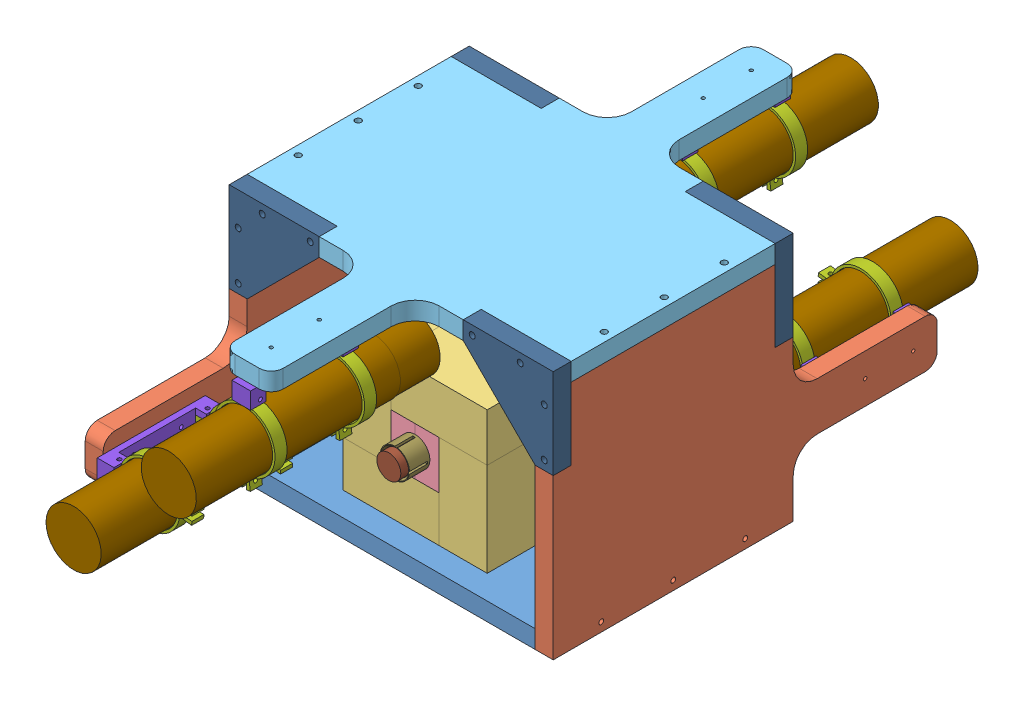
SolidWorks assembly PolarimetryAssembly.SLDASM, configuration Default (file format 8000). Lengths in mm.
Overall size (342.9 264.16 726.13).
39 component instances, 13 part files, 94 mates.
Components (placement in the parent):
- PolarimetryBasePiece-1: PolarimetryBasePiece.SLDPRT [Default] at (179.036 122.9383 224.0635) size (304.8 19.05 254)
- PolarimetrySidePiece-1: PolarimetrySidePiece.SLDPRT [Default] at (-75.8459 245.4933 261.1051) x (0 0 1) z (0 -1 0) size (406.4 19.05 245.11)
- PolarimetrySidePiece-2: PolarimetrySidePiece.SLDPRT [Default] at (228.9541 245.4933 261.1051) x (0 0 -1) z (0 -1 0) size (406.4 19.05 245.11)
- BigLeadBlock-1: BigLeadBlock.SLDPRT [Default] at (0.3541 139.4483 362.7051) x (0 0 -1) z (1 0 0) size (203.2 50.8 101.6)
- BigLeadBlock-2: BigLeadBlock.SLDPRT [Default] at (101.9541 241.0483 362.7051) x (0 0 -1) z (0 -1 0) size (203.2 50.8 101.6)
- LeadHouseInternalBlock-1: LeadHouseInternalBlock.SLDPRT [Default] at (76.5541 190.2483 261.1051) x (0 0 1) z (0 1 0) size (101.6 25.4 50.8)
- LeadHouseInternalBlock-2: LeadHouseInternalBlock.SLDPRT [Default] at (76.5541 241.0483 261.1051) x (0 0 -1) z (0 -1 0) size (101.6 25.4 50.8)
- LeadHouseInternalBlock-3: LeadHouseInternalBlock.SLDPRT [Default] at (76.5541 241.0483 261.1051) x (0 0 1) z (0 -1 0) size (101.6 25.4 50.8)
- LeadHouseInternalBlock-4: LeadHouseInternalBlock.SLDPRT [Default] at (76.5541 190.2483 261.1051) x (0 0 -1) z (0 1 0) size (101.6 25.4 50.8)
- BigLeadBlock-3: BigLeadBlock.SLDPRT [Default] at (51.1541 190.2483 362.7051) x (0 0 -1) z (0 1 0) size (203.2 50.8 101.6)
- BigLeadBlock-4: BigLeadBlock.SLDPRT [Default] at (51.1541 241.0483 362.7051) x (0 0 -1) z (1 0 0) size (203.2 50.8 101.6)
- PolarimetryTopPiece-1: PolarimetryTopPiece.SLDPRT [Default] at (76.5541 368.0483 261.1051) x (0 0 -1) z (1 0 0) size (558.8 19.05 342.9)
- PolarimetryKey-1: PolarimetryKey.SLDPRT [Default] at (209.9041 122.9383 159.5051) x (0 0 -1) z (0 -1 0) size (203.2 19.05 25.4)
- PolarimetryKey-2: PolarimetryKey.SLDPRT [Default] at (-75.8459 122.9383 159.5051) x (0 0 -1) z (0 -1 0) size (203.2 19.05 25.4)
- DetectorClamp-1: DetectorClamp.SLDPRT [Default] at (177.4211 216.0293 85.4541) x (0 -1 0) z (1 0 0) size (64.77 12.7 90.11)
- DetectorClampBar-1: DetectorClampBar.SLDPRT [Default] at (228.9541 205.7423 -24.6449) x (0 0 1) z (0 -1 0) size (114.3 17.78 19.81)
- DetectorClamp-2: DetectorClamp.SLDPRT [Default] at (177.4211 216.0293 -20.5813) x (0 1 0) z (1 0 0) size (64.77 12.7 90.11)
- DetectorModel-1: DetectorModel.SLDPRT [Default] at (177.4211 216.0293 113.0448) x (0.987772 0.155906 0) z (-0.155906 0.987772 0) size (58.42 258.57 58.42)
- DetectorClampBar-2: DetectorClampBar.SLDPRT [Default] at (66.6481 368.0483 89.6551) x (0 0 -1) z (-1 0 0) size (114.3 17.78 19.81)
- DetectorClamp-3: DetectorClamp.SLDPRT [Default] at (76.1731 316.5153 -20.5813) x (-1 0 0) z (0 1 0) size (64.77 12.7 90.11)
- DetectorClamp-4: DetectorClamp.SLDPRT [Default] at (76.1731 316.5153 85.5916) x (1 0 0) z (0 1 0) size (64.77 12.7 90.11)
- DetectorModel-2: DetectorModel.SLDPRT [Default] at (76.1731 316.5153 117.214) x (1 0 0) z (0 1 0) size (58.42 258.57 58.42)
- PolarimetryGusset-1: PolarimetryGusset.SLDPRT [Default] at (-94.8959 291.8483 153.1551) x (1 0 0) z (0 1 0) size (95.25 19.05 95.25)
- PolarimetryGusset-3: PolarimetryGusset.SLDPRT [Default] at (152.7541 387.0983 388.1051) x (0 -1 0) z (1 0 0) size (95.25 19.05 95.25)
- PolarimetryGusset-4: PolarimetryGusset.SLDPRT [Default] at (-94.8959 291.8483 388.1051) x (1 0 0) z (0 1 0) size (95.25 19.05 95.25)
- PolarimetryGusset-5: PolarimetryGusset.SLDPRT [Default] at (248.0041 291.8483 134.1051) x (-1 0 0) z (0 1 0) size (95.25 19.05 95.25)
- AluminumScatterer-1: AluminumScatterer.SLDPRT [Default] at (76.5541 215.6483 390.6451) x (1 0 0) z (0 1 0) size (25.4 25.4 25.4)
- PolarimetryAluminumHolder-1: PolarimetryAluminumHolder.SLDPRT [Default] at (76.5541 215.6483 337.3051) x (1 0 0) z (0 -1 0) size (30.99 46.99 30.99)
- PolarimetryAluminumHolder-2: PolarimetryAluminumHolder.SLDPRT [Default] at (76.5541 215.6483 184.9051) x (-0.923728 -0.383049 0) z (0.383049 -0.923728 0) size (30.99 46.99 30.99)
- AluminumScatterer-2: AluminumScatterer.SLDPRT [Default] at (76.5541 215.6483 156.9651) x (1 0 0) z (0 1 0) size (25.4 25.4 25.4)
- DetectorClampBar-3: DetectorClampBar.SLDPRT [Default] at (66.6453 368.0483 546.8508) x (0.000433 0 -1) z (-1 0 -0.000433) size (114.3 17.78 19.81)
- DetectorClampBar-4: DetectorClampBar.SLDPRT [Default] at (-75.8459 225.5543 432.5551) x (0 0 1) z (0 1 0) size (114.3 17.78 19.81)
- DetectorClamp-5: DetectorClamp.SLDPRT [Default] at (-24.4109 216.0293 543.0451) x (0 1 0) z (-1 0 0) size (64.77 12.7 90.11)
- DetectorClamp-6: DetectorClamp.SLDPRT [Default] at (-24.4109 216.0293 449.0651) x (0 1 0) z (-1 0 0) size (64.77 12.7 90.11)
- DetectorClamp-7: DetectorClamp.SLDPRT [Default] at (76.172 316.6133 543.045) x (1 0 0.000433) z (0 1 0) size (64.77 12.7 90.11)
- DetectorClamp-8: DetectorClamp.SLDPRT [Default] at (76.9747 316.6133 449.0653) x (1 0 0.000433) z (0 1 0) size (64.77 12.7 90.11)
- DetectorModel-3: DetectorModel.SLDPRT [Default] at (76.2308 316.6133 407.1793) x (0.511772 -0.859122 0.000222) z (-0.859121 -0.511772 -0.000372) size (58.42 258.57 58.42)
- DetectorModel-4: DetectorModel.SLDPRT [Default] at (-24.4109 216.0293 407.3726) x (0.993621 -0.112775 0) z (-0.112775 -0.993621 0) size (58.42 258.57 58.42)
- SmallLeadBlock-1: SmallLeadBlock.SLDPRT [Default] at (22.7686 342.6483 249.6097) x (1 0 0) z (0 -1 0) size (101.6 25.4 50.8)
Mates (geometry in assembly coordinates):
- Coincident2: coincident aligned: plane of PolarimetryBasePiece-1 through (179.036 122.9383 224.0635) normal (0 -1 0); plane of PolarimetrySidePiece-1 through (-94.8959 122.9383 261.1051) normal (0 -1 0)
- Coincident3: coincident aligned: plane of PolarimetryBasePiece-1 through (-75.8459 141.9883 388.1051) normal (0 0 1); plane of PolarimetrySidePiece-1 through (-94.8959 245.4933 388.1051) normal (0 0 1)
- Coincident4: coincident anti-aligned: plane of PolarimetryBasePiece-1 through (-75.8459 141.9883 134.1051) normal (-1 0 0); plane of PolarimetrySidePiece-1 through (-75.8459 245.4933 261.1051) normal (1 0 0)
- Coincident5: coincident aligned: plane of PolarimetryBasePiece-1 through (179.036 122.9383 224.0635) normal (0 -1 0); plane of PolarimetrySidePiece-2 through (248.0041 122.9383 261.1051) normal (0 -1 0)
- Coincident6: coincident aligned: plane of PolarimetryBasePiece-1 through (-75.8459 141.9883 388.1051) normal (0 0 1); plane of PolarimetrySidePiece-2 through (248.0041 245.4933 388.1051) normal (0 0 1)
- Coincident7: coincident anti-aligned: plane of PolarimetryBasePiece-1 through (228.9541 141.9883 134.1051) normal (1 0 0); plane of PolarimetrySidePiece-2 through (228.9541 245.4933 261.1051) normal (-1 0 0)
- Coincident8: coincident anti-aligned: plane of PolarimetryBasePiece-1 through (179.036 139.4483 224.0635) normal (0 1 0); plane of BigLeadBlock-1 through (0.3541 139.4483 362.7051) normal (0 -1 0)
- Coincident9: coincident anti-aligned: plane of PolarimetryBasePiece-1 through (0.3541 139.4483 362.7051) normal (1 0 0); plane of BigLeadBlock-1 through (0.3541 190.2483 362.7051) normal (-1 0 0)
- Coincident10: coincident anti-aligned: plane of PolarimetryBasePiece-1 through (0.3541 139.4483 362.7051) normal (0 0 -1); plane of BigLeadBlock-1 through (0.3541 190.2483 362.7051) normal (0 0 1)
- Coincident11: coincident anti-aligned: plane of PolarimetryBasePiece-1 through (179.036 139.4483 224.0635) normal (0 1 0); plane of BigLeadBlock-2 through (152.7541 139.4483 362.7051) normal (0 -1 0)
- Coincident12: coincident anti-aligned: plane of BigLeadBlock-1 through (101.9541 190.2483 362.7051) normal (1 0 0); plane of BigLeadBlock-2 through (101.9541 241.0483 362.7051) normal (-1 0 0)
- Coincident13: coincident anti-aligned: plane of PolarimetryBasePiece-1 through (0.3541 139.4483 362.7051) normal (0 0 -1); plane of BigLeadBlock-2 through (152.7541 241.0483 362.7051) normal (0 0 1)
- Coincident14: coincident anti-aligned: plane of BigLeadBlock-1 through (0.3541 190.2483 362.7051) normal (0 1 0); plane of LeadHouseInternalBlock-1 through (101.9541 190.2483 261.1051) normal (0 -1 0)
- Coincident15: coincident anti-aligned: plane of BigLeadBlock-2 through (101.9541 241.0483 362.7051) normal (-1 0 0); plane of LeadHouseInternalBlock-1 through (101.9541 190.2483 261.1051) normal (1 0 0)
- Coincident16: coincident aligned: plane of BigLeadBlock-2 through (152.7541 241.0483 362.7051) normal (0 0 1); plane of LeadHouseInternalBlock-1 through (101.9541 190.2483 362.7051) normal (0 0 1)
- Coincident17: coincident anti-aligned: plane of LeadHouseInternalBlock-1 through (101.9541 190.2483 261.1051) normal (0 0 -1); plane of LeadHouseInternalBlock-2 through (101.9541 241.0483 261.1051) normal (0 0 1)
- Coincident18: coincident anti-aligned: circle of LeadHouseInternalBlock-1; circle of LeadHouseInternalBlock-2
- Coincident19: coincident aligned: plane of LeadHouseInternalBlock-1 through (101.9541 241.0483 261.1051) normal (0 1 0); plane of LeadHouseInternalBlock-2 through (101.9541 241.0483 261.1051) normal (0 1 0)
- Coincident20: coincident anti-aligned: plane of BigLeadBlock-1 through (0.3541 190.2483 362.7051) normal (0 1 0); plane of LeadHouseInternalBlock-3 through (51.1541 190.2483 261.1051) normal (0 -1 0)
- Coincident21: coincident aligned: circle of LeadHouseInternalBlock-1; circle of LeadHouseInternalBlock-3
- Coincident22: coincident anti-aligned: circle of LeadHouseInternalBlock-3; circle of LeadHouseInternalBlock-4
- Coincident23: coincident anti-aligned: plane of BigLeadBlock-1 through (0.3541 190.2483 362.7051) normal (0 1 0); plane of LeadHouseInternalBlock-4 through (51.1541 190.2483 261.1051) normal (0 -1 0)
- Coincident25: coincident anti-aligned: plane of BigLeadBlock-1 through (0.3541 190.2483 362.7051) normal (0 1 0); plane of BigLeadBlock-3 through (0.3541 190.2483 362.7051) normal (0 -1 0)
- Coincident26: coincident aligned: plane of BigLeadBlock-1 through (0.3541 190.2483 159.5051) normal (0 0 -1); plane of BigLeadBlock-3 through (0.3541 190.2483 159.5051) normal (0 0 -1)
- Coincident27: coincident aligned: plane of BigLeadBlock-1 through (0.3541 190.2483 362.7051) normal (-1 0 0); plane of BigLeadBlock-3 through (0.3541 190.2483 362.7051) normal (-1 0 0)
- Coincident28: coincident anti-aligned: plane of BigLeadBlock-3 through (51.1541 190.2483 362.7051) normal (1 0 0); plane of BigLeadBlock-4 through (51.1541 291.8483 362.7051) normal (-1 0 0)
- Coincident29: coincident anti-aligned: plane of BigLeadBlock-2 through (152.7541 241.0483 362.7051) normal (0 1 0); plane of BigLeadBlock-4 through (51.1541 241.0483 362.7051) normal (0 -1 0)
- Coincident30: coincident aligned: plane of BigLeadBlock-2 through (152.7541 241.0483 362.7051) normal (0 0 1); plane of BigLeadBlock-4 through (51.1541 291.8483 362.7051) normal (0 0 1)
- Coincident31: coincident anti-aligned: plane of PolarimetrySidePiece-1 through (-94.8959 368.0483 261.1051) normal (0 1 0); plane of PolarimetryTopPiece-1 through (76.5541 368.0483 261.1051) normal (0 -1 0)
- Coincident32: coincident aligned: plane of PolarimetrySidePiece-1 through (-94.8959 245.4933 388.1051) normal (0 0 1); plane of PolarimetryTopPiece-1 through (76.5541 387.0983 388.1051) normal (0 0 1)
- Coincident33: coincident aligned: plane of PolarimetrySidePiece-1 through (-94.8959 245.4933 261.1051) normal (-1 0 0); plane of PolarimetryTopPiece-1 through (-94.8959 387.0983 261.1051) normal (-1 0 0)
- Coincident38: coincident anti-aligned: plane of PolarimetryBasePiece-1 through (-75.8459 122.9383 362.7051) normal (0 0 -1); plane of PolarimetryKey-2 through (-56.7959 122.9383 362.7051) normal (0 0 1)
- Coincident40: coincident anti-aligned: plane of PolarimetrySidePiece-2 through (228.9541 245.4933 261.1051) normal (-1 0 0); plane of DetectorClampBar-1 through (228.9541 205.7423 -24.6449) normal (1 0 0)
- Concentric1: concentric aligned: circle of PolarimetrySidePiece-2; circle of DetectorClampBar-1
- Parallel1: parallel anti-aligned: plane of DetectorClamp-1 through (222.5061 219.2043 72.7541) normal (1 0 0); plane of DetectorClampBar-1 through (222.6041 205.7423 -24.6449) normal (-1 0 0)
- Coincident46: coincident aligned: circle of DetectorClamp-1; plane of DetectorClampBar-1 through (211.1741 219.2043 85.8451) normal (0 -1 0)
- Concentric3: concentric anti-aligned: circle of PolarimetrySidePiece-2; circle of DetectorClampBar-1
- Parallel2: parallel anti-aligned: plane of DetectorClampBar-1 through (222.6041 205.7423 -24.6449) normal (-1 0 0); plane of DetectorClamp-2 through (222.5061 212.8543 -7.8813) normal (1 0 0)
- Coincident47: coincident aligned: circle of DetectorClampBar-1; circle of DetectorClamp-2
- Concentric4: concentric anti-aligned: cylinder of DetectorClamp-2 through (177.4211 216.0293 -7.8813) axis (0 0 -1) radius 29.845; cylinder of DetectorModel-1 through (177.4211 216.0293 -102.8552) axis (0 0 1) radius 29.21
- Coincident48: coincident anti-aligned: plane of PolarimetryTopPiece-1 through (76.5541 368.0483 261.1051) normal (0 -1 0); plane of DetectorClampBar-2 through (66.6481 368.0483 89.6551) normal (0 1 0)
- Concentric5: concentric aligned: circle of PolarimetryTopPiece-1; circle of DetectorClampBar-2
- Concentric6: concentric anti-aligned: circle of PolarimetryTopPiece-1; circle of DetectorClampBar-2
- Parallel3: parallel anti-aligned: plane of DetectorClampBar-2 through (66.6481 361.6983 89.6551) normal (0 -1 0); plane of DetectorClamp-3 through (79.3481 361.6003 -7.8813) normal (0 1 0)
- Coincident50: coincident aligned: circle of DetectorClamp-3; circle of DetectorClampBar-2
- Parallel4: parallel anti-aligned: plane of DetectorClampBar-2 through (66.6481 361.6983 89.6551) normal (0 -1 0); plane of DetectorClamp-4 through (72.9981 361.6003 72.8916) normal (0 1 0)
- Coincident52: coincident anti-aligned: circle of DetectorClampBar-2; circle of DetectorClamp-4
- Concentric7: concentric anti-aligned: cylinder of DetectorClamp-3 through (76.1731 316.5153 -7.8813) axis (0 0 -1) radius 29.845; cylinder of DetectorModel-2 through (76.1731 316.5153 -98.686) axis (0 0 1) radius 29.21
- Parallel5: parallel aligned: plane of DetectorModel-1 through (177.4211 216.0293 155.7168) normal (0 0 1); plane of DetectorModel-2 through (76.1731 316.5153 159.886) normal (0 0 1)
- Coincident54: coincident anti-aligned: plane of PolarimetrySidePiece-1 through (-75.8459 245.4933 261.1051) normal (1 0 0); plane of PolarimetryKey-2 through (-75.8459 122.9383 159.5051) normal (-1 0 0)
- Parallel7: parallel aligned: plane of PolarimetrySidePiece-1 through (-94.8959 122.9383 261.1051) normal (0 -1 0); plane of PolarimetryKey-2 through (-56.7959 122.9383 159.5051) normal (0 -1 0)
- Coincident56: coincident anti-aligned: plane of PolarimetrySidePiece-2 through (228.9541 245.4933 261.1051) normal (-1 0 0); plane of PolarimetryKey-1 through (228.9541 122.9383 159.5051) normal (1 0 0)
- Coincident62: coincident anti-aligned: plane of PolarimetryTopPiece-1 through (76.5541 368.0483 153.1551) normal (0 0 -1); plane of PolarimetryGusset-1 through (-94.8959 291.8483 153.1551) normal (0 0 1)
- Coincident63: coincident aligned: plane of PolarimetryTopPiece-1 through (76.5541 387.0983 261.1051) normal (0 1 0); plane of PolarimetryGusset-1 through (-94.8959 387.0983 134.1051) normal (0 1 0)
- Coincident67: coincident aligned: plane of PolarimetryTopPiece-1 through (76.5541 387.0983 261.1051) normal (0 1 0); plane of PolarimetryGusset-3 through (152.7541 387.0983 369.0551) normal (0 1 0)
- Coincident68: coincident anti-aligned: plane of PolarimetryTopPiece-1 through (76.5541 368.0483 369.0551) normal (0 0 1); plane of PolarimetryGusset-3 through (152.7541 387.0983 369.0551) normal (0 0 -1)
- Coincident69: coincident aligned: plane of PolarimetrySidePiece-2 through (248.0041 245.4933 261.1051) normal (1 0 0); plane of PolarimetryGusset-3 through (248.0041 387.0983 369.0551) normal (1 0 0)
- Coincident70: coincident anti-aligned: plane of PolarimetryTopPiece-1 through (76.5541 368.0483 369.0551) normal (0 0 1); plane of PolarimetryGusset-4 through (-94.8959 291.8483 369.0551) normal (0 0 -1)
- Coincident71: coincident aligned: plane of PolarimetryTopPiece-1 through (76.5541 387.0983 261.1051) normal (0 1 0); plane of PolarimetryGusset-4 through (-94.8959 387.0983 369.0551) normal (0 1 0)
- Coincident72: coincident aligned: plane of PolarimetrySidePiece-1 through (-94.8959 245.4933 261.1051) normal (-1 0 0); plane of PolarimetryGusset-4 through (-94.8959 291.8483 369.0551) normal (-1 0 0)
- Coincident73: coincident aligned: plane of PolarimetryTopPiece-1 through (76.5541 387.0983 261.1051) normal (0 1 0); plane of PolarimetryGusset-5 through (248.0041 387.0983 153.1551) normal (0 1 0)
- Coincident74: coincident aligned: plane of PolarimetrySidePiece-2 through (248.0041 245.4933 261.1051) normal (1 0 0); plane of PolarimetryGusset-5 through (248.0041 291.8483 153.1551) normal (1 0 0)
- Coincident75: coincident aligned: plane of PolarimetryTopPiece-1 through (76.5541 387.0983 134.1051) normal (0 0 -1); plane of PolarimetryGusset-5 through (248.0041 291.8483 134.1051) normal (0 0 -1)
- Coincident76: coincident aligned: plane of PolarimetryBasePiece-1 through (179.036 122.9383 224.0635) normal (0 -1 0); plane of PolarimetryKey-1 through (228.9541 122.9383 159.5051) normal (0 -1 0)
- Coincident78: coincident anti-aligned: plane of PolarimetryBasePiece-1 through (228.9541 122.9383 159.5051) normal (0 0 1); plane of PolarimetryKey-1 through (228.9541 122.9383 159.5051) normal (0 0 -1)
- Concentric9: concentric anti-aligned: cylinder of LeadHouseInternalBlock-3 through (76.5541 215.6483 314.4451) axis (0 0 1) radius 12.7; cylinder of PolarimetryAluminumHolder-1 through (76.5541 215.6483 362.7051) axis (0 0 -1) radius 12.7
- Coincident80: coincident aligned: plane of LeadHouseInternalBlock-3 through (51.1541 241.0483 362.7051) normal (0 0 1); circle of PolarimetryAluminumHolder-1
- Coincident81: coincident anti-aligned: plane of AluminumScatterer-1 through (76.5541 215.6483 365.2451) normal (0 0 -1); plane of PolarimetryAluminumHolder-1 through (76.5541 215.6483 365.2451) normal (0 0 1)
- Concentric10: concentric aligned: cylinder of AluminumScatterer-1 through (76.5541 215.6483 365.2451) axis (0 0 1) radius 12.7; cylinder of PolarimetryAluminumHolder-1 through (76.5541 215.6483 365.2451) axis (0 0 1) radius 12.954
- Coincident82: coincident aligned: plane of LeadHouseInternalBlock-2 through (101.9541 241.0483 159.5051) normal (0 0 -1); circle of PolarimetryAluminumHolder-2
- Concentric11: concentric anti-aligned: cylinder of LeadHouseInternalBlock-2 through (76.5541 215.6483 207.7651) axis (0 0 -1) radius 12.7; cylinder of PolarimetryAluminumHolder-2 through (76.5541 215.6483 137.9151) axis (0 0 1) radius 15.494
- Coincident83: coincident aligned: plane of PolarimetryAluminumHolder-2 through (76.5541 215.6483 156.9651) normal (0 0 -1); circle of AluminumScatterer-2
- Concentric12: concentric anti-aligned: cylinder of PolarimetryAluminumHolder-2 through (76.5541 215.6483 156.9651) axis (0 0 -1) radius 12.954; cylinder of AluminumScatterer-2 through (76.5541 215.6483 131.5651) axis (0 0 1) radius 12.7
- Coincident84: coincident anti-aligned: plane of PolarimetryTopPiece-1 through (76.5541 368.0483 261.1051) normal (0 -1 0); plane of DetectorClampBar-3 through (66.6453 368.0483 546.8508) normal (0 1 0)
- Concentric14: concentric anti-aligned: circle of PolarimetryTopPiece-1; circle of DetectorClampBar-3
- Concentric15: concentric aligned: circle of PolarimetryTopPiece-1; circle of DetectorClampBar-3
- Coincident86: coincident anti-aligned: plane of PolarimetrySidePiece-1 through (-75.8459 245.4933 261.1051) normal (1 0 0); plane of DetectorClampBar-4 through (-75.8459 225.5543 432.5551) normal (-1 0 0)
- Concentric16: concentric anti-aligned: circle of PolarimetrySidePiece-1; circle of DetectorClampBar-4
- Concentric17: concentric aligned: circle of PolarimetrySidePiece-1; circle of DetectorClampBar-4
- Coincident87: coincident anti-aligned: plane of DetectorClampBar-4 through (-58.0659 219.2043 543.0451) normal (0 -1 0); plane of DetectorClamp-5 through (-24.4109 219.2043 543.0451) normal (0 1 0)
- Coincident88: coincident anti-aligned: plane of DetectorClampBar-4 through (-69.4959 225.5543 432.5551) normal (1 0 0); plane of DetectorClamp-5 through (-69.4959 212.8543 530.3451) normal (-1 0 0)
- Coincident89: coincident anti-aligned: plane of DetectorClampBar-4 through (-58.0659 205.7423 543.0451) normal (0 0 -1); plane of DetectorClamp-5 through (-24.4109 216.0293 543.0451) normal (0 0 1)
- Coincident90: coincident anti-aligned: plane of DetectorClampBar-4 through (-69.4959 225.5543 432.5551) normal (1 0 0); plane of DetectorClamp-6 through (-69.4959 212.8543 436.3651) normal (-1 0 0)
- Coincident91: coincident anti-aligned: plane of DetectorClampBar-4 through (-58.0659 219.2043 436.3651) normal (0 -1 0); plane of DetectorClamp-6 through (-24.4109 219.2043 449.0651) normal (0 1 0)
- Coincident92: coincident anti-aligned: plane of DetectorClampBar-4 through (-58.0659 205.7423 436.3651) normal (0 0 1); plane of DetectorClamp-6 through (-24.4109 216.0293 436.3651) normal (0 0 -1)
- Coincident93: coincident anti-aligned: plane of DetectorClampBar-3 through (66.6453 361.6983 546.8508) normal (0 -1 0); plane of DetectorClamp-7 through (73.0025 361.6983 530.3436) normal (0 1 0)
- Coincident94: coincident anti-aligned: plane of DetectorClampBar-3 through (72.997 350.2683 543.0436) normal (1 0 0.000433); plane of DetectorClamp-7 through (72.997 316.6133 543.0436) normal (-1 0 -0.000433)
- Coincident95: coincident anti-aligned: plane of DetectorClampBar-3 through (86.459 350.2683 543.0494) normal (0.000433 0 -1); plane of DetectorClamp-7 through (76.172 316.6133 543.045) normal (-0.000433 0 1)
- Coincident96: coincident anti-aligned: plane of DetectorClampBar-3 through (66.6453 361.6983 546.8508) normal (0 -1 0); plane of DetectorClamp-8 through (73.8052 361.6983 436.3639) normal (0 1 0)
- Coincident97: coincident anti-aligned: plane of DetectorClampBar-3 through (80.1552 350.2683 436.3667) normal (-1 0 -0.000433); plane of DetectorClamp-8 through (80.1497 316.6133 449.0667) normal (1 0 0.000433)
- Coincident98: coincident anti-aligned: plane of DetectorClampBar-3 through (86.5052 350.2683 436.3694) normal (-0.000433 0 1); plane of DetectorClamp-8 through (76.9802 316.6133 436.3653) normal (0.000433 0 -1)
- Concentric18: concentric anti-aligned: cylinder of DetectorClamp-7 through (76.1775 316.6133 530.345) axis (-0.000433 0 1) radius 29.845; cylinder of DetectorModel-3 through (76.1373 316.6133 623.0793) axis (0.000433 0 -1) radius 29.21
- Concentric19: concentric anti-aligned: cylinder of DetectorClamp-5 through (-24.4109 216.0293 530.3451) axis (0 0 1) radius 29.845; cylinder of DetectorModel-4 through (-24.4109 216.0293 623.2726) axis (0 0 -1) radius 29.21
- Coincident101: coincident anti-aligned: plane of BigLeadBlock-4 through (51.1541 291.8483 362.7051) normal (0 1 0); plane of SmallLeadBlock-1 through (22.7686 291.8483 275.0097) normal (0 -1 0)
